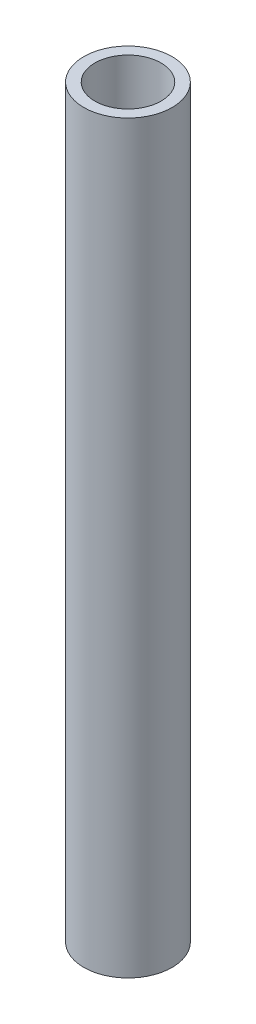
from build123d import *

# Parameters (mm, degrees)
SKETCH1_R           = 8
SKETCH1_R_2         = 6
BOSS_EXTRUDE1_DEPTH = 135


with BuildPart() as part:
    # Sketch1 → Boss-Extrude1 (new body)
    with BuildSketch(Plane(origin=(0, 0, 0), x_dir=(1, 0, 0), z_dir=(0, 1, 0))):
        with Locations(Location((0, 0, 0), (0, 0, 270))):
            Circle(SKETCH1_R)
        with Locations(Location((0, 0, 0), (0, 0, 270))):
            Circle(SKETCH1_R_2, mode=Mode.SUBTRACT)
    extrude(amount=BOSS_EXTRUDE1_DEPTH)


solid = part.part
